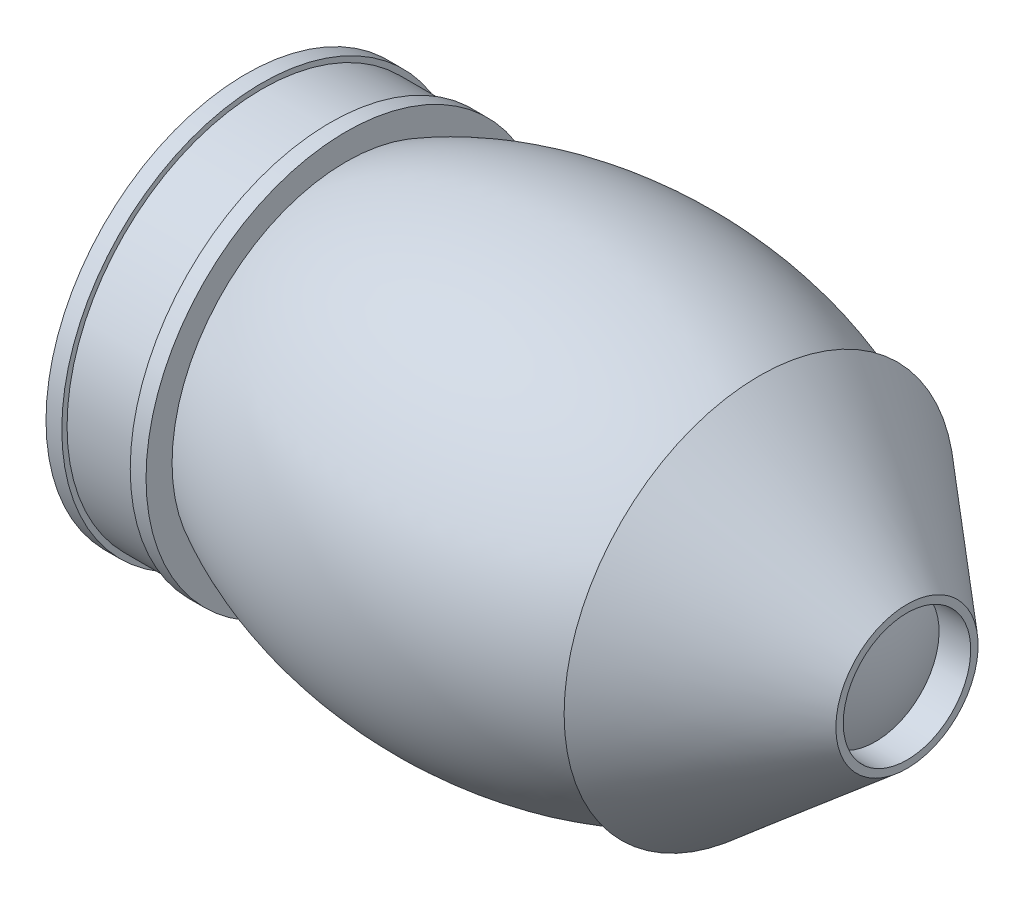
from build123d import *


with BuildPart() as part:
    # Sketch2 → Revolve1 (revolve)
    with BuildSketch(Plane.XY):
        with BuildLine():
            Line((-31.75, 0), (158.75, 0))
            add(Edge.make_bspline(
                [(158.75, 0), (158.75, 63.5), (63.5, 63.5), (-31.75, 63.5), (-31.75, 0)],
                knots=[3.141592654, 3.141592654, 3.141592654, 4.71238898, 4.71238898, 6.283185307, 6.283185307, 6.283185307], degree=2, weights=[1, 0.707106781, 1, 0.707106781, 1]))
        make_face()
    revolve(axis=Axis((-100.8728466, 0, 0), (1, 0, 0)))

    # Sketch3 → Revolve2 (revolve)
    with BuildSketch(Plane.XY, mode=Mode.PRIVATE) as revolve2_sk:
        Polygon((3.99300739, 0), (3.99300739, 57), (-0.50699261, 57), (-0.50699261, 55.5), (-20.00699261, 55.5), (-20.00699261, 57), (-24.50699261, 57), (-24.50699261, 0), align=None)
        Polygon((118.939033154, 50.656801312), (121.748755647, 55.643211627), (163.789229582, 20.267803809), (163.789229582, 18.154089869), (118.939033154, 18.154089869), align=None)
    revolve(revolve2_sk.sketch.rotate(Axis((-41.402971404, 0, 0), (1, 0, 0)), 90), axis=Axis((-41.402971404, 0, 0), (1, 0, 0)))


solid = part.part
